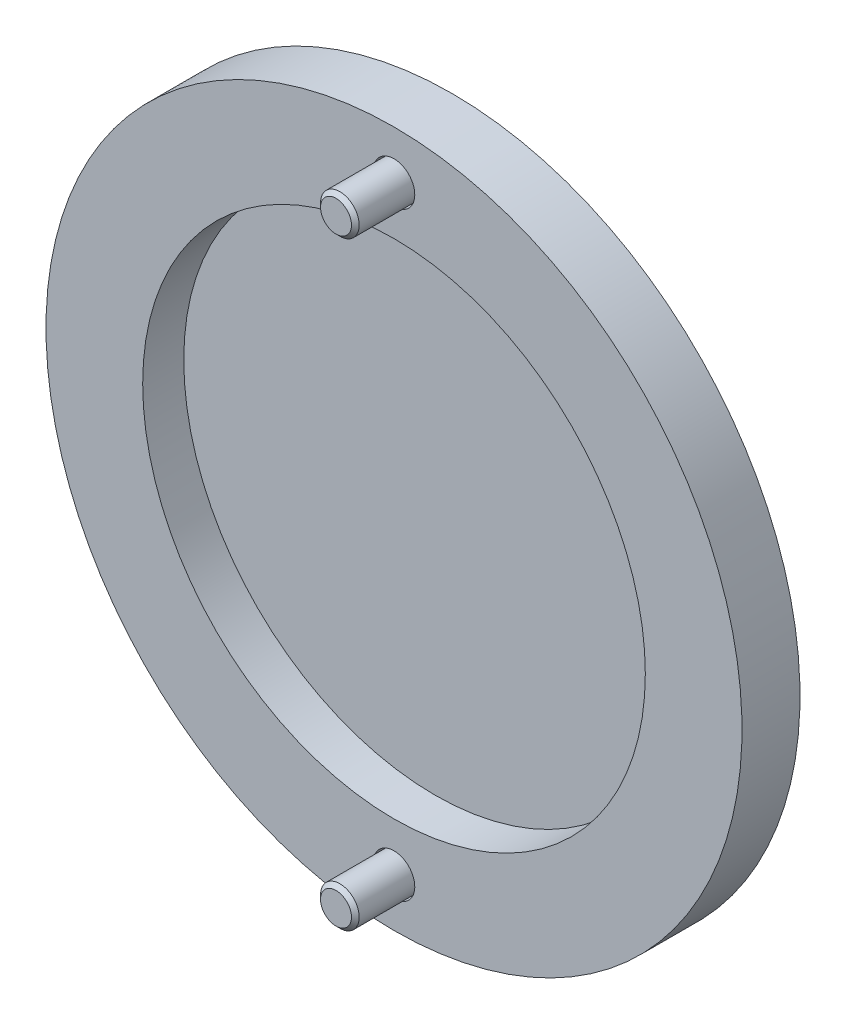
ISO-10303-21;
HEADER;
FILE_DESCRIPTION(('STEP AP214'),'2;1');
FILE_NAME('part.step','',(''),(''),'','','');
FILE_SCHEMA(('AUTOMOTIVE_DESIGN { 1 0 10303 214 1 1 1 1 }'));
ENDSEC;
DATA;
#1=APPLICATION_CONTEXT('core data for automotive mechanical design processes');
#2=APPLICATION_PROTOCOL_DEFINITION('international standard','automotive_design',2000,#1);
#3=PRODUCT_CONTEXT('',#1,'mechanical');
#4=PRODUCT('Part','Part','',(#3));
#5=PRODUCT_RELATED_PRODUCT_CATEGORY('part','',(#4));
#6=PRODUCT_DEFINITION_FORMATION('','',#4);
#7=PRODUCT_DEFINITION_CONTEXT('part definition',#1,'design');
#8=PRODUCT_DEFINITION('design','',#6,#7);
#9=PRODUCT_DEFINITION_SHAPE('','',#8);
#10=(LENGTH_UNIT() NAMED_UNIT(*) SI_UNIT(.MILLI.,.METRE.));
#11=(NAMED_UNIT(*) PLANE_ANGLE_UNIT() SI_UNIT($,.RADIAN.));
#12=(NAMED_UNIT(*) SI_UNIT($,.STERADIAN.) SOLID_ANGLE_UNIT());
#13=UNCERTAINTY_MEASURE_WITH_UNIT(LENGTH_MEASURE(1.E-05),#10,'distance_accuracy_value','');
#14=(GEOMETRIC_REPRESENTATION_CONTEXT(3) GLOBAL_UNCERTAINTY_ASSIGNED_CONTEXT((#13)) GLOBAL_UNIT_ASSIGNED_CONTEXT((#10,
#11,#12)) REPRESENTATION_CONTEXT('',''));
#15=CARTESIAN_POINT('',(0.,0.,0.));
#16=DIRECTION('',(0.,0.,1.));
#17=DIRECTION('',(1.,0.,0.));
#18=AXIS2_PLACEMENT_3D('',#15,#16,#17);
#19=CARTESIAN_POINT('',(-0.866025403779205,-32.5,-4.00000000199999));
#20=DIRECTION('',(0.,0.,-1.));
#21=DIRECTION('',(-1.,0.,0.));
#22=AXIS2_PLACEMENT_3D('',#19,#20,#21);
#23=PLANE('',#22);
#24=DIRECTION('',(-1.,0.,0.));
#25=VECTOR('',#24,1.);
#26=CARTESIAN_POINT('',(0.866025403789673,-32.5,-4.00000000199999));
#27=LINE('',#26,#25);
#28=CARTESIAN_POINT('',(0.866025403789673,-32.5,-4.00000000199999));
#29=VERTEX_POINT('',#28);
#30=CARTESIAN_POINT('',(-0.866025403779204,-32.5,-4.00000000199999));
#31=VERTEX_POINT('',#30);
#32=EDGE_CURVE('E747',#29,#31,#27,.T.);
#33=ORIENTED_EDGE('',*,*,#32,.T.);
#34=DIRECTION('',(-0.5,0.866025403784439,0.));
#35=VECTOR('',#34,1.);
#36=CARTESIAN_POINT('',(-0.866025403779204,-32.5,-4.00000000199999));
#37=LINE('',#36,#35);
#38=CARTESIAN_POINT('',(-1.73205080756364,-31.,-4.00000000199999));
#39=VERTEX_POINT('',#38);
#40=EDGE_CURVE('E752',#31,#39,#37,.T.);
#41=ORIENTED_EDGE('',*,*,#40,.T.);
#42=DIRECTION('',(0.5,0.866025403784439,0.));
#43=VECTOR('',#42,1.);
#44=CARTESIAN_POINT('',(-1.73205080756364,-31.,-4.00000000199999));
#45=LINE('',#44,#43);
#46=CARTESIAN_POINT('',(-0.866025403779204,-29.5,-4.00000000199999));
#47=VERTEX_POINT('',#46);
#48=EDGE_CURVE('E755',#39,#47,#45,.T.);
#49=ORIENTED_EDGE('',*,*,#48,.T.);
#50=DIRECTION('',(1.,0.,0.));
#51=VECTOR('',#50,1.);
#52=CARTESIAN_POINT('',(-0.866025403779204,-29.5,-4.00000000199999));
#53=LINE('',#52,#51);
#54=CARTESIAN_POINT('',(0.866025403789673,-29.5,-4.00000000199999));
#55=VERTEX_POINT('',#54);
#56=EDGE_CURVE('E137',#47,#55,#53,.T.);
#57=ORIENTED_EDGE('',*,*,#56,.T.);
#58=DIRECTION('',(0.5,-0.866025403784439,0.));
#59=VECTOR('',#58,1.);
#60=CARTESIAN_POINT('',(0.866025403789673,-29.5,-4.00000000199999));
#61=LINE('',#60,#59);
#62=CARTESIAN_POINT('',(1.73205080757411,-31.,-4.00000000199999));
#63=VERTEX_POINT('',#62);
#64=EDGE_CURVE('E120',#55,#63,#61,.T.);
#65=ORIENTED_EDGE('',*,*,#64,.T.);
#66=DIRECTION('',(-0.5,-0.866025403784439,0.));
#67=VECTOR('',#66,1.);
#68=CARTESIAN_POINT('',(1.73205080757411,-31.,-4.00000000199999));
#69=LINE('',#68,#67);
#70=EDGE_CURVE('E134',#63,#29,#69,.T.);
#71=ORIENTED_EDGE('',*,*,#70,.T.);
#72=EDGE_LOOP('',(#33,#41,#49,#57,#65,#71));
#73=FACE_BOUND('',#72,.T.);
#74=ADVANCED_FACE('F16',(#73),#23,.T.);
#75=CARTESIAN_POINT('',(-0.866025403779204,-32.5,-4.00000000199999));
#76=DIRECTION('',(-0.866025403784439,-0.5,0.));
#77=DIRECTION('',(-0.5,0.866025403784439,0.));
#78=AXIS2_PLACEMENT_3D('',#75,#76,#77);
#79=PLANE('',#78);
#80=DIRECTION('',(-0.5,0.866025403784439,0.));
#81=VECTOR('',#80,1.);
#82=CARTESIAN_POINT('',(-0.866025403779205,-32.5,-6.000000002));
#83=LINE('',#82,#81);
#84=CARTESIAN_POINT('',(-0.866025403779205,-32.5,-6.000000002));
#85=VERTEX_POINT('',#84);
#86=CARTESIAN_POINT('',(-1.73205080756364,-31.,-6.000000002));
#87=VERTEX_POINT('',#86);
#88=EDGE_CURVE('E758',#85,#87,#83,.T.);
#89=ORIENTED_EDGE('',*,*,#88,.T.);
#90=DIRECTION('',(0.,0.,-1.));
#91=VECTOR('',#90,1.);
#92=CARTESIAN_POINT('',(-1.73205080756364,-31.,-4.00000000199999));
#93=LINE('',#92,#91);
#94=EDGE_CURVE('E91',#39,#87,#93,.T.);
#95=ORIENTED_EDGE('',*,*,#94,.F.);
#96=ORIENTED_EDGE('',*,*,#40,.F.);
#97=DIRECTION('',(0.,0.,-1.));
#98=VECTOR('',#97,1.);
#99=CARTESIAN_POINT('',(-0.866025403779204,-32.5,-4.00000000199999));
#100=LINE('',#99,#98);
#101=EDGE_CURVE('E141',#31,#85,#100,.T.);
#102=ORIENTED_EDGE('',*,*,#101,.T.);
#103=EDGE_LOOP('',(#89,#95,#96,#102));
#104=FACE_BOUND('',#103,.T.);
#105=ADVANCED_FACE('F409',(#104),#79,.F.);
#106=CARTESIAN_POINT('',(-1.73205080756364,-31.,-4.00000000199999));
#107=DIRECTION('',(-0.866025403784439,0.5,0.));
#108=DIRECTION('',(0.5,0.866025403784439,0.));
#109=AXIS2_PLACEMENT_3D('',#106,#107,#108);
#110=PLANE('',#109);
#111=DIRECTION('',(0.5,0.866025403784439,0.));
#112=VECTOR('',#111,1.);
#113=CARTESIAN_POINT('',(-1.73205080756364,-31.,-6.000000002));
#114=LINE('',#113,#112);
#115=CARTESIAN_POINT('',(-0.866025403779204,-29.5,-6.000000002));
#116=VERTEX_POINT('',#115);
#117=EDGE_CURVE('E742',#87,#116,#114,.T.);
#118=ORIENTED_EDGE('',*,*,#117,.T.);
#119=DIRECTION('',(0.,0.,-1.));
#120=VECTOR('',#119,1.);
#121=CARTESIAN_POINT('',(-0.866025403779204,-29.5,-4.00000000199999));
#122=LINE('',#121,#120);
#123=EDGE_CURVE('E149',#47,#116,#122,.T.);
#124=ORIENTED_EDGE('',*,*,#123,.F.);
#125=ORIENTED_EDGE('',*,*,#48,.F.);
#126=ORIENTED_EDGE('',*,*,#94,.T.);
#127=EDGE_LOOP('',(#118,#124,#125,#126));
#128=FACE_BOUND('',#127,.T.);
#129=ADVANCED_FACE('F412',(#128),#110,.F.);
#130=CARTESIAN_POINT('',(-0.866025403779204,-29.5,-4.00000000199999));
#131=DIRECTION('',(0.,1.,0.));
#132=DIRECTION('',(1.,0.,0.));
#133=AXIS2_PLACEMENT_3D('',#130,#131,#132);
#134=PLANE('',#133);
#135=DIRECTION('',(1.,0.,0.));
#136=VECTOR('',#135,1.);
#137=CARTESIAN_POINT('',(-0.866025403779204,-29.5,-6.000000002));
#138=LINE('',#137,#136);
#139=CARTESIAN_POINT('',(0.866025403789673,-29.5,-6.000000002));
#140=VERTEX_POINT('',#139);
#141=EDGE_CURVE('E740',#116,#140,#138,.T.);
#142=ORIENTED_EDGE('',*,*,#141,.T.);
#143=DIRECTION('',(0.,0.,-1.));
#144=VECTOR('',#143,1.);
#145=CARTESIAN_POINT('',(0.866025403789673,-29.5,-4.00000000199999));
#146=LINE('',#145,#144);
#147=EDGE_CURVE('E129',#55,#140,#146,.T.);
#148=ORIENTED_EDGE('',*,*,#147,.F.);
#149=ORIENTED_EDGE('',*,*,#56,.F.);
#150=ORIENTED_EDGE('',*,*,#123,.T.);
#151=EDGE_LOOP('',(#142,#148,#149,#150));
#152=FACE_BOUND('',#151,.T.);
#153=ADVANCED_FACE('F416',(#152),#134,.F.);
#154=CARTESIAN_POINT('',(0.866025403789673,-29.5,-4.00000000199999));
#155=DIRECTION('',(0.866025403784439,0.5,0.));
#156=DIRECTION('',(0.5,-0.866025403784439,0.));
#157=AXIS2_PLACEMENT_3D('',#154,#155,#156);
#158=PLANE('',#157);
#159=DIRECTION('',(0.5,-0.866025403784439,0.));
#160=VECTOR('',#159,1.);
#161=CARTESIAN_POINT('',(0.866025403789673,-29.5,-6.000000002));
#162=LINE('',#161,#160);
#163=CARTESIAN_POINT('',(1.73205080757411,-31.,-6.000000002));
#164=VERTEX_POINT('',#163);
#165=EDGE_CURVE('E123',#140,#164,#162,.T.);
#166=ORIENTED_EDGE('',*,*,#165,.T.);
#167=DIRECTION('',(0.,0.,-1.));
#168=VECTOR('',#167,1.);
#169=CARTESIAN_POINT('',(1.73205080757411,-31.,-4.00000000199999));
#170=LINE('',#169,#168);
#171=EDGE_CURVE('E117',#63,#164,#170,.T.);
#172=ORIENTED_EDGE('',*,*,#171,.F.);
#173=ORIENTED_EDGE('',*,*,#64,.F.);
#174=ORIENTED_EDGE('',*,*,#147,.T.);
#175=EDGE_LOOP('',(#166,#172,#173,#174));
#176=FACE_BOUND('',#175,.T.);
#177=ADVANCED_FACE('F119',(#176),#158,.F.);
#178=CARTESIAN_POINT('',(1.73205080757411,-31.,-4.00000000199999));
#179=DIRECTION('',(0.866025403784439,-0.5,0.));
#180=DIRECTION('',(-0.5,-0.866025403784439,0.));
#181=AXIS2_PLACEMENT_3D('',#178,#179,#180);
#182=PLANE('',#181);
#183=DIRECTION('',(-0.5,-0.866025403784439,0.));
#184=VECTOR('',#183,1.);
#185=CARTESIAN_POINT('',(1.73205080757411,-31.,-6.000000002));
#186=LINE('',#185,#184);
#187=CARTESIAN_POINT('',(0.866025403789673,-32.5,-6.000000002));
#188=VERTEX_POINT('',#187);
#189=EDGE_CURVE('E745',#164,#188,#186,.T.);
#190=ORIENTED_EDGE('',*,*,#189,.T.);
#191=DIRECTION('',(0.,0.,-1.));
#192=VECTOR('',#191,1.);
#193=CARTESIAN_POINT('',(0.866025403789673,-32.5,-4.00000000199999));
#194=LINE('',#193,#192);
#195=EDGE_CURVE('E128',#29,#188,#194,.T.);
#196=ORIENTED_EDGE('',*,*,#195,.F.);
#197=ORIENTED_EDGE('',*,*,#70,.F.);
#198=ORIENTED_EDGE('',*,*,#171,.T.);
#199=EDGE_LOOP('',(#190,#196,#197,#198));
#200=FACE_BOUND('',#199,.T.);
#201=ADVANCED_FACE('F139',(#200),#182,.F.);
#202=CARTESIAN_POINT('',(0.866025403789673,-32.5,-4.00000000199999));
#203=DIRECTION('',(0.,-1.,0.));
#204=DIRECTION('',(-1.,0.,0.));
#205=AXIS2_PLACEMENT_3D('',#202,#203,#204);
#206=PLANE('',#205);
#207=DIRECTION('',(-1.,0.,0.));
#208=VECTOR('',#207,1.);
#209=CARTESIAN_POINT('',(0.866025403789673,-32.5,-6.000000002));
#210=LINE('',#209,#208);
#211=EDGE_CURVE('E35',#188,#85,#210,.T.);
#212=ORIENTED_EDGE('',*,*,#211,.T.);
#213=ORIENTED_EDGE('',*,*,#101,.F.);
#214=ORIENTED_EDGE('',*,*,#32,.F.);
#215=ORIENTED_EDGE('',*,*,#195,.T.);
#216=EDGE_LOOP('',(#212,#213,#214,#215));
#217=FACE_BOUND('',#216,.T.);
#218=ADVANCED_FACE('F395',(#217),#206,.F.);
#219=CARTESIAN_POINT('',(0.,-27.9,-6.000000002));
#220=DIRECTION('',(0.,0.,-1.));
#221=DIRECTION('',(-1.,0.,0.));
#222=AXIS2_PLACEMENT_3D('',#219,#220,#221);
#223=PLANE('',#222);
#224=ORIENTED_EDGE('',*,*,#211,.F.);
#225=ORIENTED_EDGE('',*,*,#189,.F.);
#226=ORIENTED_EDGE('',*,*,#165,.F.);
#227=ORIENTED_EDGE('',*,*,#141,.F.);
#228=ORIENTED_EDGE('',*,*,#117,.F.);
#229=ORIENTED_EDGE('',*,*,#88,.F.);
#230=EDGE_LOOP('',(#224,#225,#226,#227,#228,#229));
#231=FACE_BOUND('',#230,.T.);
#232=CARTESIAN_POINT('',(0.,-31.,-6.000000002));
#233=DIRECTION('',(0.,0.,1.));
#234=DIRECTION('',(1.,0.,0.));
#235=AXIS2_PLACEMENT_3D('',#232,#233,#234);
#236=CIRCLE('',#235,3.1);
#237=CARTESIAN_POINT('',(3.09999999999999,-31.,-6.000000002));
#238=VERTEX_POINT('',#237);
#239=EDGE_CURVE('E157',#238,#238,#236,.T.);
#240=ORIENTED_EDGE('',*,*,#239,.F.);
#241=EDGE_LOOP('',(#240));
#242=FACE_BOUND('',#241,.T.);
#243=ADVANCED_FACE('F391',(#231,#242),#223,.T.);
#244=CARTESIAN_POINT('',(0.,-31.,-5.600000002));
#245=DIRECTION('',(0.,0.,1.));
#246=DIRECTION('',(1.,0.,0.));
#247=AXIS2_PLACEMENT_3D('',#244,#245,#246);
#248=CONICAL_SURFACE('',#247,3.5,0.78539816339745);
#249=ORIENTED_EDGE('',*,*,#239,.T.);
#250=EDGE_LOOP('',(#249));
#251=FACE_BOUND('',#250,.T.);
#252=CARTESIAN_POINT('',(0.,-31.,-5.600000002));
#253=DIRECTION('',(0.,0.,1.));
#254=DIRECTION('',(1.,0.,0.));
#255=AXIS2_PLACEMENT_3D('',#252,#253,#254);
#256=CIRCLE('',#255,3.5);
#257=CARTESIAN_POINT('',(3.49999999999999,-31.,-5.600000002));
#258=VERTEX_POINT('',#257);
#259=EDGE_CURVE('E160',#258,#258,#256,.T.);
#260=ORIENTED_EDGE('',*,*,#259,.F.);
#261=EDGE_LOOP('',(#260));
#262=FACE_BOUND('',#261,.T.);
#263=ADVANCED_FACE('F387',(#251,#262),#248,.T.);
#264=CARTESIAN_POINT('',(0.,-31.,-2.00000000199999));
#265=DIRECTION('',(0.,0.,1.));
#266=DIRECTION('',(1.,0.,0.));
#267=AXIS2_PLACEMENT_3D('',#264,#265,#266);
#268=CYLINDRICAL_SURFACE('',#267,3.5);
#269=ORIENTED_EDGE('',*,*,#259,.T.);
#270=EDGE_LOOP('',(#269));
#271=FACE_BOUND('',#270,.T.);
#272=CARTESIAN_POINT('',(0.,-31.,-2.00000000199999));
#273=DIRECTION('',(0.,0.,1.));
#274=DIRECTION('',(1.,0.,0.));
#275=AXIS2_PLACEMENT_3D('',#272,#273,#274);
#276=CIRCLE('',#275,3.5);
#277=CARTESIAN_POINT('',(3.49999999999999,-31.,-2.00000000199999));
#278=VERTEX_POINT('',#277);
#279=EDGE_CURVE('E163',#278,#278,#276,.T.);
#280=ORIENTED_EDGE('',*,*,#279,.F.);
#281=EDGE_LOOP('',(#280));
#282=FACE_BOUND('',#281,.T.);
#283=ADVANCED_FACE('F383',(#271,#282),#268,.T.);
#284=CARTESIAN_POINT('',(0.,-31.,-2.00000000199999));
#285=DIRECTION('',(0.,0.,1.));
#286=DIRECTION('',(1.,0.,0.));
#287=AXIS2_PLACEMENT_3D('',#284,#285,#286);
#288=PLANE('',#287);
#289=CARTESIAN_POINT('',(0.,-31.,-2.00000000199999));
#290=DIRECTION('',(0.,0.,1.));
#291=DIRECTION('',(1.,0.,0.));
#292=AXIS2_PLACEMENT_3D('',#289,#290,#291);
#293=CIRCLE('',#292,2.);
#294=CARTESIAN_POINT('',(1.99999999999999,-31.,-2.00000000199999));
#295=VERTEX_POINT('',#294);
#296=EDGE_CURVE('E26',#295,#295,#293,.T.);
#297=ORIENTED_EDGE('',*,*,#296,.F.);
#298=EDGE_LOOP('',(#297));
#299=FACE_BOUND('',#298,.T.);
#300=CARTESIAN_POINT('',(0.,-31.,-2.00000000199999));
#301=DIRECTION('',(0.,0.,1.));
#302=DIRECTION('',(0.,-1.,0.));
#303=AXIS2_PLACEMENT_3D('',#300,#301,#302);
#304=CIRCLE('',#303,2.15);
#305=CARTESIAN_POINT('',(0.,-33.15,-2.00000000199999));
#306=VERTEX_POINT('',#305);
#307=EDGE_CURVE('E10',#306,#306,#304,.T.);
#308=ORIENTED_EDGE('',*,*,#307,.T.);
#309=EDGE_LOOP('',(#308));
#310=FACE_BOUND('',#309,.T.);
#311=ADVANCED_FACE('F379',(#299,#310),#288,.T.);
#312=CARTESIAN_POINT('',(0.,-31.,5.999999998));
#313=DIRECTION('',(0.,0.,1.));
#314=DIRECTION('',(1.,0.,0.));
#315=AXIS2_PLACEMENT_3D('',#312,#313,#314);
#316=PLANE('',#315);
#317=CARTESIAN_POINT('',(0.,-31.,5.999999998));
#318=DIRECTION('',(0.,0.,1.));
#319=DIRECTION('',(1.,0.,0.));
#320=AXIS2_PLACEMENT_3D('',#317,#318,#319);
#321=CIRCLE('',#320,1.6);
#322=CARTESIAN_POINT('',(1.6,-31.,5.999999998));
#323=VERTEX_POINT('',#322);
#324=EDGE_CURVE('E154',#323,#323,#321,.T.);
#325=ORIENTED_EDGE('',*,*,#324,.T.);
#326=EDGE_LOOP('',(#325));
#327=FACE_BOUND('',#326,.T.);
#328=ADVANCED_FACE('F382',(#327),#316,.T.);
#329=CARTESIAN_POINT('',(0.,-31.,5.999999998));
#330=DIRECTION('',(0.,0.,-1.));
#331=DIRECTION('',(-1.,0.,0.));
#332=AXIS2_PLACEMENT_3D('',#329,#330,#331);
#333=CONICAL_SURFACE('',#332,1.6,0.78539816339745);
#334=CARTESIAN_POINT('',(0.,-31.,5.599999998));
#335=DIRECTION('',(0.,0.,1.));
#336=DIRECTION('',(1.,0.,0.));
#337=AXIS2_PLACEMENT_3D('',#334,#335,#336);
#338=CIRCLE('',#337,2.);
#339=CARTESIAN_POINT('',(2.,-31.,5.599999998));
#340=VERTEX_POINT('',#339);
#341=EDGE_CURVE('E146',#340,#340,#338,.T.);
#342=ORIENTED_EDGE('',*,*,#341,.T.);
#343=EDGE_LOOP('',(#342));
#344=FACE_BOUND('',#343,.T.);
#345=ORIENTED_EDGE('',*,*,#324,.F.);
#346=EDGE_LOOP('',(#345));
#347=FACE_BOUND('',#346,.T.);
#348=ADVANCED_FACE('F399',(#344,#347),#333,.T.);
#349=CARTESIAN_POINT('',(0.,-31.,-2.00000000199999));
#350=DIRECTION('',(0.,0.,1.));
#351=DIRECTION('',(1.,0.,0.));
#352=AXIS2_PLACEMENT_3D('',#349,#350,#351);
#353=CYLINDRICAL_SURFACE('',#352,2.);
#354=ORIENTED_EDGE('',*,*,#296,.T.);
#355=EDGE_LOOP('',(#354));
#356=FACE_BOUND('',#355,.T.);
#357=ORIENTED_EDGE('',*,*,#341,.F.);
#358=EDGE_LOOP('',(#357));
#359=FACE_BOUND('',#358,.T.);
#360=ADVANCED_FACE('F377',(#356,#359),#353,.T.);
#361=CARTESIAN_POINT('',(-0.866025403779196,29.5,-4.00000000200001));
#362=DIRECTION('',(0.,0.,-1.));
#363=DIRECTION('',(-1.,0.,0.));
#364=AXIS2_PLACEMENT_3D('',#361,#362,#363);
#365=PLANE('',#364);
#366=DIRECTION('',(-1.,0.,0.));
#367=VECTOR('',#366,1.);
#368=CARTESIAN_POINT('',(0.866025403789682,29.5,-4.00000000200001));
#369=LINE('',#368,#367);
#370=CARTESIAN_POINT('',(0.866025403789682,29.5,-4.00000000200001));
#371=VERTEX_POINT('',#370);
#372=CARTESIAN_POINT('',(-0.866025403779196,29.5,-4.00000000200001));
#373=VERTEX_POINT('',#372);
#374=EDGE_CURVE('E183',#371,#373,#369,.T.);
#375=ORIENTED_EDGE('',*,*,#374,.T.);
#376=DIRECTION('',(-0.5,0.866025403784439,0.));
#377=VECTOR('',#376,1.);
#378=CARTESIAN_POINT('',(-0.866025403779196,29.5,-4.00000000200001));
#379=LINE('',#378,#377);
#380=CARTESIAN_POINT('',(-1.73205080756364,31.,-4.00000000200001));
#381=VERTEX_POINT('',#380);
#382=EDGE_CURVE('E186',#373,#381,#379,.T.);
#383=ORIENTED_EDGE('',*,*,#382,.T.);
#384=DIRECTION('',(0.5,0.866025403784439,0.));
#385=VECTOR('',#384,1.);
#386=CARTESIAN_POINT('',(-1.73205080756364,31.,-4.00000000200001));
#387=LINE('',#386,#385);
#388=CARTESIAN_POINT('',(-0.866025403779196,32.5,-4.00000000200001));
#389=VERTEX_POINT('',#388);
#390=EDGE_CURVE('E189',#381,#389,#387,.T.);
#391=ORIENTED_EDGE('',*,*,#390,.T.);
#392=DIRECTION('',(1.,0.,0.));
#393=VECTOR('',#392,1.);
#394=CARTESIAN_POINT('',(-0.866025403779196,32.5,-4.00000000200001));
#395=LINE('',#394,#393);
#396=CARTESIAN_POINT('',(0.866025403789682,32.5,-4.00000000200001));
#397=VERTEX_POINT('',#396);
#398=EDGE_CURVE('E192',#389,#397,#395,.T.);
#399=ORIENTED_EDGE('',*,*,#398,.T.);
#400=DIRECTION('',(0.5,-0.866025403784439,0.));
#401=VECTOR('',#400,1.);
#402=CARTESIAN_POINT('',(0.866025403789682,32.5,-4.00000000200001));
#403=LINE('',#402,#401);
#404=CARTESIAN_POINT('',(1.73205080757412,31.,-4.00000000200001));
#405=VERTEX_POINT('',#404);
#406=EDGE_CURVE('E195',#397,#405,#403,.T.);
#407=ORIENTED_EDGE('',*,*,#406,.T.);
#408=DIRECTION('',(-0.5,-0.866025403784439,0.));
#409=VECTOR('',#408,1.);
#410=CARTESIAN_POINT('',(1.73205080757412,31.,-4.00000000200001));
#411=LINE('',#410,#409);
#412=EDGE_CURVE('E198',#405,#371,#411,.T.);
#413=ORIENTED_EDGE('',*,*,#412,.T.);
#414=EDGE_LOOP('',(#375,#383,#391,#399,#407,#413));
#415=FACE_BOUND('',#414,.T.);
#416=ADVANCED_FACE('F300',(#415),#365,.T.);
#417=CARTESIAN_POINT('',(-0.866025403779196,29.5,-4.00000000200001));
#418=DIRECTION('',(-0.866025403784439,-0.5,0.));
#419=DIRECTION('',(-0.5,0.866025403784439,0.));
#420=AXIS2_PLACEMENT_3D('',#417,#418,#419);
#421=PLANE('',#420);
#422=DIRECTION('',(-0.5,0.866025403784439,0.));
#423=VECTOR('',#422,1.);
#424=CARTESIAN_POINT('',(-0.866025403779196,29.5,-6.00000000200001));
#425=LINE('',#424,#423);
#426=CARTESIAN_POINT('',(-0.866025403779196,29.5,-6.00000000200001));
#427=VERTEX_POINT('',#426);
#428=CARTESIAN_POINT('',(-1.73205080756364,31.,-6.00000000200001));
#429=VERTEX_POINT('',#428);
#430=EDGE_CURVE('E169',#427,#429,#425,.T.);
#431=ORIENTED_EDGE('',*,*,#430,.T.);
#432=DIRECTION('',(0.,0.,-1.));
#433=VECTOR('',#432,1.);
#434=CARTESIAN_POINT('',(-1.73205080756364,31.,-4.00000000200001));
#435=LINE('',#434,#433);
#436=EDGE_CURVE('E210',#381,#429,#435,.T.);
#437=ORIENTED_EDGE('',*,*,#436,.F.);
#438=ORIENTED_EDGE('',*,*,#382,.F.);
#439=DIRECTION('',(0.,0.,-1.));
#440=VECTOR('',#439,1.);
#441=CARTESIAN_POINT('',(-0.866025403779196,29.5,-4.00000000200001));
#442=LINE('',#441,#440);
#443=EDGE_CURVE('E201',#373,#427,#442,.T.);
#444=ORIENTED_EDGE('',*,*,#443,.T.);
#445=EDGE_LOOP('',(#431,#437,#438,#444));
#446=FACE_BOUND('',#445,.T.);
#447=ADVANCED_FACE('F357',(#446),#421,.F.);
#448=CARTESIAN_POINT('',(-1.73205080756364,31.,-4.00000000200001));
#449=DIRECTION('',(-0.866025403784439,0.5,0.));
#450=DIRECTION('',(0.5,0.866025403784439,0.));
#451=AXIS2_PLACEMENT_3D('',#448,#449,#450);
#452=PLANE('',#451);
#453=DIRECTION('',(0.5,0.866025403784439,0.));
#454=VECTOR('',#453,1.);
#455=CARTESIAN_POINT('',(-1.73205080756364,31.,-6.00000000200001));
#456=LINE('',#455,#454);
#457=CARTESIAN_POINT('',(-0.866025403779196,32.5,-6.00000000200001));
#458=VERTEX_POINT('',#457);
#459=EDGE_CURVE('E172',#429,#458,#456,.T.);
#460=ORIENTED_EDGE('',*,*,#459,.T.);
#461=DIRECTION('',(0.,0.,-1.));
#462=VECTOR('',#461,1.);
#463=CARTESIAN_POINT('',(-0.866025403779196,32.5,-4.00000000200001));
#464=LINE('',#463,#462);
#465=EDGE_CURVE('E208',#389,#458,#464,.T.);
#466=ORIENTED_EDGE('',*,*,#465,.F.);
#467=ORIENTED_EDGE('',*,*,#390,.F.);
#468=ORIENTED_EDGE('',*,*,#436,.T.);
#469=EDGE_LOOP('',(#460,#466,#467,#468));
#470=FACE_BOUND('',#469,.T.);
#471=ADVANCED_FACE('F360',(#470),#452,.F.);
#472=CARTESIAN_POINT('',(-0.866025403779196,32.5,-4.00000000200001));
#473=DIRECTION('',(0.,1.,0.));
#474=DIRECTION('',(1.,0.,0.));
#475=AXIS2_PLACEMENT_3D('',#472,#473,#474);
#476=PLANE('',#475);
#477=DIRECTION('',(1.,0.,0.));
#478=VECTOR('',#477,1.);
#479=CARTESIAN_POINT('',(-0.866025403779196,32.5,-6.00000000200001));
#480=LINE('',#479,#478);
#481=CARTESIAN_POINT('',(0.866025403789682,32.5,-6.00000000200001));
#482=VERTEX_POINT('',#481);
#483=EDGE_CURVE('E175',#458,#482,#480,.T.);
#484=ORIENTED_EDGE('',*,*,#483,.T.);
#485=DIRECTION('',(0.,0.,-1.));
#486=VECTOR('',#485,1.);
#487=CARTESIAN_POINT('',(0.866025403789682,32.5,-4.00000000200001));
#488=LINE('',#487,#486);
#489=EDGE_CURVE('E206',#397,#482,#488,.T.);
#490=ORIENTED_EDGE('',*,*,#489,.F.);
#491=ORIENTED_EDGE('',*,*,#398,.F.);
#492=ORIENTED_EDGE('',*,*,#465,.T.);
#493=EDGE_LOOP('',(#484,#490,#491,#492));
#494=FACE_BOUND('',#493,.T.);
#495=ADVANCED_FACE('F364',(#494),#476,.F.);
#496=CARTESIAN_POINT('',(0.866025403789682,32.5,-4.00000000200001));
#497=DIRECTION('',(0.866025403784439,0.5,0.));
#498=DIRECTION('',(0.5,-0.866025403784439,0.));
#499=AXIS2_PLACEMENT_3D('',#496,#497,#498);
#500=PLANE('',#499);
#501=DIRECTION('',(0.5,-0.866025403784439,0.));
#502=VECTOR('',#501,1.);
#503=CARTESIAN_POINT('',(0.866025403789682,32.5,-6.00000000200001));
#504=LINE('',#503,#502);
#505=CARTESIAN_POINT('',(1.73205080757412,31.,-6.00000000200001));
#506=VERTEX_POINT('',#505);
#507=EDGE_CURVE('E178',#482,#506,#504,.T.);
#508=ORIENTED_EDGE('',*,*,#507,.T.);
#509=DIRECTION('',(0.,0.,-1.));
#510=VECTOR('',#509,1.);
#511=CARTESIAN_POINT('',(1.73205080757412,31.,-4.00000000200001));
#512=LINE('',#511,#510);
#513=EDGE_CURVE('E204',#405,#506,#512,.T.);
#514=ORIENTED_EDGE('',*,*,#513,.F.);
#515=ORIENTED_EDGE('',*,*,#406,.F.);
#516=ORIENTED_EDGE('',*,*,#489,.T.);
#517=EDGE_LOOP('',(#508,#514,#515,#516));
#518=FACE_BOUND('',#517,.T.);
#519=ADVANCED_FACE('F368',(#518),#500,.F.);
#520=CARTESIAN_POINT('',(1.73205080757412,31.,-4.00000000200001));
#521=DIRECTION('',(0.866025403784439,-0.5,0.));
#522=DIRECTION('',(-0.5,-0.866025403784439,0.));
#523=AXIS2_PLACEMENT_3D('',#520,#521,#522);
#524=PLANE('',#523);
#525=DIRECTION('',(-0.5,-0.866025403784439,0.));
#526=VECTOR('',#525,1.);
#527=CARTESIAN_POINT('',(1.73205080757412,31.,-6.00000000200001));
#528=LINE('',#527,#526);
#529=CARTESIAN_POINT('',(0.866025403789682,29.5,-6.00000000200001));
#530=VERTEX_POINT('',#529);
#531=EDGE_CURVE('E181',#506,#530,#528,.T.);
#532=ORIENTED_EDGE('',*,*,#531,.T.);
#533=DIRECTION('',(0.,0.,-1.));
#534=VECTOR('',#533,1.);
#535=CARTESIAN_POINT('',(0.866025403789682,29.5,-4.00000000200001));
#536=LINE('',#535,#534);
#537=EDGE_CURVE('E76',#371,#530,#536,.T.);
#538=ORIENTED_EDGE('',*,*,#537,.F.);
#539=ORIENTED_EDGE('',*,*,#412,.F.);
#540=ORIENTED_EDGE('',*,*,#513,.T.);
#541=EDGE_LOOP('',(#532,#538,#539,#540));
#542=FACE_BOUND('',#541,.T.);
#543=ADVANCED_FACE('F356',(#542),#524,.F.);
#544=CARTESIAN_POINT('',(0.866025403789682,29.5,-4.00000000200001));
#545=DIRECTION('',(0.,-1.,0.));
#546=DIRECTION('',(-1.,0.,0.));
#547=AXIS2_PLACEMENT_3D('',#544,#545,#546);
#548=PLANE('',#547);
#549=DIRECTION('',(-1.,0.,0.));
#550=VECTOR('',#549,1.);
#551=CARTESIAN_POINT('',(0.866025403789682,29.5,-6.00000000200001));
#552=LINE('',#551,#550);
#553=EDGE_CURVE('E82',#530,#427,#552,.T.);
#554=ORIENTED_EDGE('',*,*,#553,.T.);
#555=ORIENTED_EDGE('',*,*,#443,.F.);
#556=ORIENTED_EDGE('',*,*,#374,.F.);
#557=ORIENTED_EDGE('',*,*,#537,.T.);
#558=EDGE_LOOP('',(#554,#555,#556,#557));
#559=FACE_BOUND('',#558,.T.);
#560=ADVANCED_FACE('F343',(#559),#548,.F.);
#561=CARTESIAN_POINT('',(0.,34.1,-6.00000000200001));
#562=DIRECTION('',(0.,0.,-1.));
#563=DIRECTION('',(-1.,0.,0.));
#564=AXIS2_PLACEMENT_3D('',#561,#562,#563);
#565=PLANE('',#564);
#566=ORIENTED_EDGE('',*,*,#553,.F.);
#567=ORIENTED_EDGE('',*,*,#531,.F.);
#568=ORIENTED_EDGE('',*,*,#507,.F.);
#569=ORIENTED_EDGE('',*,*,#483,.F.);
#570=ORIENTED_EDGE('',*,*,#459,.F.);
#571=ORIENTED_EDGE('',*,*,#430,.F.);
#572=EDGE_LOOP('',(#566,#567,#568,#569,#570,#571));
#573=FACE_BOUND('',#572,.T.);
#574=CARTESIAN_POINT('',(0.,31.,-6.00000000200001));
#575=DIRECTION('',(0.,0.,1.));
#576=DIRECTION('',(1.,0.,0.));
#577=AXIS2_PLACEMENT_3D('',#574,#575,#576);
#578=CIRCLE('',#577,3.1);
#579=CARTESIAN_POINT('',(3.1,31.,-6.00000000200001));
#580=VERTEX_POINT('',#579);
#581=EDGE_CURVE('E218',#580,#580,#578,.T.);
#582=ORIENTED_EDGE('',*,*,#581,.F.);
#583=EDGE_LOOP('',(#582));
#584=FACE_BOUND('',#583,.T.);
#585=ADVANCED_FACE('F340',(#573,#584),#565,.T.);
#586=CARTESIAN_POINT('',(0.,31.,5.99999999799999));
#587=DIRECTION('',(0.,0.,1.));
#588=DIRECTION('',(1.,0.,0.));
#589=AXIS2_PLACEMENT_3D('',#586,#587,#588);
#590=PLANE('',#589);
#591=CARTESIAN_POINT('',(0.,31.,5.99999999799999));
#592=DIRECTION('',(0.,0.,1.));
#593=DIRECTION('',(1.,0.,0.));
#594=AXIS2_PLACEMENT_3D('',#591,#592,#593);
#595=CIRCLE('',#594,1.6);
#596=CARTESIAN_POINT('',(1.6,31.,5.99999999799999));
#597=VERTEX_POINT('',#596);
#598=EDGE_CURVE('E215',#597,#597,#595,.T.);
#599=ORIENTED_EDGE('',*,*,#598,.T.);
#600=EDGE_LOOP('',(#599));
#601=FACE_BOUND('',#600,.T.);
#602=ADVANCED_FACE('F277',(#601),#590,.T.);
#603=CARTESIAN_POINT('',(0.,31.,-5.60000000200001));
#604=DIRECTION('',(0.,0.,1.));
#605=DIRECTION('',(1.,0.,0.));
#606=AXIS2_PLACEMENT_3D('',#603,#604,#605);
#607=CONICAL_SURFACE('',#606,3.5,0.78539816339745);
#608=ORIENTED_EDGE('',*,*,#581,.T.);
#609=EDGE_LOOP('',(#608));
#610=FACE_BOUND('',#609,.T.);
#611=CARTESIAN_POINT('',(0.,31.,-5.60000000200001));
#612=DIRECTION('',(0.,0.,1.));
#613=DIRECTION('',(1.,0.,0.));
#614=AXIS2_PLACEMENT_3D('',#611,#612,#613);
#615=CIRCLE('',#614,3.5);
#616=CARTESIAN_POINT('',(3.5,31.,-5.60000000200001));
#617=VERTEX_POINT('',#616);
#618=EDGE_CURVE('E221',#617,#617,#615,.T.);
#619=ORIENTED_EDGE('',*,*,#618,.F.);
#620=EDGE_LOOP('',(#619));
#621=FACE_BOUND('',#620,.T.);
#622=ADVANCED_FACE('F336',(#610,#621),#607,.T.);
#623=CARTESIAN_POINT('',(0.,31.,5.99999999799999));
#624=DIRECTION('',(0.,0.,-1.));
#625=DIRECTION('',(-1.,0.,0.));
#626=AXIS2_PLACEMENT_3D('',#623,#624,#625);
#627=CONICAL_SURFACE('',#626,1.6,0.78539816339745);
#628=CARTESIAN_POINT('',(0.,31.,5.599999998));
#629=DIRECTION('',(0.,0.,1.));
#630=DIRECTION('',(1.,0.,0.));
#631=AXIS2_PLACEMENT_3D('',#628,#629,#630);
#632=CIRCLE('',#631,2.);
#633=CARTESIAN_POINT('',(2.,31.,5.599999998));
#634=VERTEX_POINT('',#633);
#635=EDGE_CURVE('E203',#634,#634,#632,.T.);
#636=ORIENTED_EDGE('',*,*,#635,.T.);
#637=EDGE_LOOP('',(#636));
#638=FACE_BOUND('',#637,.T.);
#639=ORIENTED_EDGE('',*,*,#598,.F.);
#640=EDGE_LOOP('',(#639));
#641=FACE_BOUND('',#640,.T.);
#642=ADVANCED_FACE('F334',(#638,#641),#627,.T.);
#643=CARTESIAN_POINT('',(0.,31.,-2.00000000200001));
#644=DIRECTION('',(0.,0.,1.));
#645=DIRECTION('',(1.,0.,0.));
#646=AXIS2_PLACEMENT_3D('',#643,#644,#645);
#647=CYLINDRICAL_SURFACE('',#646,3.5);
#648=ORIENTED_EDGE('',*,*,#618,.T.);
#649=EDGE_LOOP('',(#648));
#650=FACE_BOUND('',#649,.T.);
#651=CARTESIAN_POINT('',(0.,31.,-2.00000000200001));
#652=DIRECTION('',(0.,0.,1.));
#653=DIRECTION('',(1.,0.,0.));
#654=AXIS2_PLACEMENT_3D('',#651,#652,#653);
#655=CIRCLE('',#654,3.5);
#656=CARTESIAN_POINT('',(3.5,31.,-2.00000000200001));
#657=VERTEX_POINT('',#656);
#658=EDGE_CURVE('E224',#657,#657,#655,.T.);
#659=ORIENTED_EDGE('',*,*,#658,.F.);
#660=EDGE_LOOP('',(#659));
#661=FACE_BOUND('',#660,.T.);
#662=ADVANCED_FACE('F278',(#650,#661),#647,.T.);
#663=CARTESIAN_POINT('',(0.,31.,-2.00000000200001));
#664=DIRECTION('',(0.,0.,1.));
#665=DIRECTION('',(1.,0.,0.));
#666=AXIS2_PLACEMENT_3D('',#663,#664,#665);
#667=CYLINDRICAL_SURFACE('',#666,2.);
#668=CARTESIAN_POINT('',(0.,31.,-2.00000000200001));
#669=DIRECTION('',(0.,0.,1.));
#670=DIRECTION('',(1.,0.,0.));
#671=AXIS2_PLACEMENT_3D('',#668,#669,#670);
#672=CIRCLE('',#671,2.);
#673=CARTESIAN_POINT('',(2.,31.,-2.00000000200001));
#674=VERTEX_POINT('',#673);
#675=EDGE_CURVE('E227',#674,#674,#672,.T.);
#676=ORIENTED_EDGE('',*,*,#675,.T.);
#677=EDGE_LOOP('',(#676));
#678=FACE_BOUND('',#677,.T.);
#679=ORIENTED_EDGE('',*,*,#635,.F.);
#680=EDGE_LOOP('',(#679));
#681=FACE_BOUND('',#680,.T.);
#682=ADVANCED_FACE('F279',(#678,#681),#667,.T.);
#683=CARTESIAN_POINT('',(0.,33.15,-2.00000000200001));
#684=DIRECTION('',(0.,0.,1.));
#685=DIRECTION('',(0.,-1.,0.));
#686=AXIS2_PLACEMENT_3D('',#683,#684,#685);
#687=PLANE('',#686);
#688=ORIENTED_EDGE('',*,*,#658,.T.);
#689=EDGE_LOOP('',(#688));
#690=FACE_BOUND('',#689,.T.);
#691=CARTESIAN_POINT('',(0.,31.,-2.00000000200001));
#692=DIRECTION('',(0.,0.,-1.));
#693=DIRECTION('',(0.,1.,0.));
#694=AXIS2_PLACEMENT_3D('',#691,#692,#693);
#695=CIRCLE('',#694,4.);
#696=CARTESIAN_POINT('',(0.,35.,-2.00000000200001));
#697=VERTEX_POINT('',#696);
#698=EDGE_CURVE('E245',#697,#697,#695,.T.);
#699=ORIENTED_EDGE('',*,*,#698,.T.);
#700=EDGE_LOOP('',(#699));
#701=FACE_BOUND('',#700,.T.);
#702=ADVANCED_FACE('F268',(#690,#701),#687,.F.);
#703=CARTESIAN_POINT('',(0.,0.,-4.249999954));
#704=DIRECTION('',(0.,0.,-1.));
#705=DIRECTION('',(0.,1.,0.));
#706=AXIS2_PLACEMENT_3D('',#703,#704,#705);
#707=PLANE('',#706);
#708=CARTESIAN_POINT('',(0.,0.,-4.249999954));
#709=DIRECTION('',(0.,0.,-1.));
#710=DIRECTION('',(0.,1.,0.));
#711=AXIS2_PLACEMENT_3D('',#708,#709,#710);
#712=CIRCLE('',#711,26.);
#713=CARTESIAN_POINT('',(0.,26.,-4.249999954));
#714=VERTEX_POINT('',#713);
#715=EDGE_CURVE('E20',#714,#714,#712,.T.);
#716=ORIENTED_EDGE('',*,*,#715,.F.);
#717=EDGE_LOOP('',(#716));
#718=FACE_BOUND('',#717,.T.);
#719=ADVANCED_FACE('F265',(#718),#707,.F.);
#720=CARTESIAN_POINT('',(0.,31.,-2.00000000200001));
#721=DIRECTION('',(0.,0.,1.));
#722=DIRECTION('',(1.,0.,0.));
#723=AXIS2_PLACEMENT_3D('',#720,#721,#722);
#724=PLANE('',#723);
#725=ORIENTED_EDGE('',*,*,#675,.F.);
#726=EDGE_LOOP('',(#725));
#727=FACE_BOUND('',#726,.T.);
#728=CARTESIAN_POINT('',(0.,31.,-2.00000000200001));
#729=DIRECTION('',(0.,0.,1.));
#730=DIRECTION('',(0.,-1.,0.));
#731=AXIS2_PLACEMENT_3D('',#728,#729,#730);
#732=CIRCLE('',#731,2.15);
#733=CARTESIAN_POINT('',(0.,28.85,-2.000000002));
#734=VERTEX_POINT('',#733);
#735=EDGE_CURVE('E230',#734,#734,#732,.T.);
#736=ORIENTED_EDGE('',*,*,#735,.T.);
#737=EDGE_LOOP('',(#736));
#738=FACE_BOUND('',#737,.T.);
#739=ADVANCED_FACE('F267',(#727,#738),#724,.T.);
#740=CARTESIAN_POINT('',(0.,0.,-6.000000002));
#741=DIRECTION('',(0.,0.,-1.));
#742=DIRECTION('',(0.,1.,0.));
#743=AXIS2_PLACEMENT_3D('',#740,#741,#742);
#744=CYLINDRICAL_SURFACE('',#743,26.);
#745=CARTESIAN_POINT('',(0.,0.,0.));
#746=DIRECTION('',(0.,0.,-1.));
#747=DIRECTION('',(0.,1.,0.));
#748=AXIS2_PLACEMENT_3D('',#745,#746,#747);
#749=CIRCLE('',#748,26.);
#750=CARTESIAN_POINT('',(0.,26.,0.));
#751=VERTEX_POINT('',#750);
#752=EDGE_CURVE('E256',#751,#751,#749,.T.);
#753=ORIENTED_EDGE('',*,*,#752,.F.);
#754=EDGE_LOOP('',(#753));
#755=FACE_BOUND('',#754,.T.);
#756=ORIENTED_EDGE('',*,*,#715,.T.);
#757=EDGE_LOOP('',(#756));
#758=FACE_BOUND('',#757,.T.);
#759=ADVANCED_FACE('F263',(#755,#758),#744,.F.);
#760=CARTESIAN_POINT('',(0.,0.,-6.000000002));
#761=DIRECTION('',(0.,0.,-1.));
#762=DIRECTION('',(0.,1.,0.));
#763=AXIS2_PLACEMENT_3D('',#760,#761,#762);
#764=CYLINDRICAL_SURFACE('',#763,36.);
#765=CARTESIAN_POINT('',(0.,0.,-6.000000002));
#766=DIRECTION('',(0.,0.,-1.));
#767=DIRECTION('',(0.,1.,0.));
#768=AXIS2_PLACEMENT_3D('',#765,#766,#767);
#769=CIRCLE('',#768,36.);
#770=CARTESIAN_POINT('',(0.,36.,-6.00000000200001));
#771=VERTEX_POINT('',#770);
#772=EDGE_CURVE('E251',#771,#771,#769,.T.);
#773=ORIENTED_EDGE('',*,*,#772,.F.);
#774=EDGE_LOOP('',(#773));
#775=FACE_BOUND('',#774,.T.);
#776=CARTESIAN_POINT('',(0.,0.,0.));
#777=DIRECTION('',(0.,0.,-1.));
#778=DIRECTION('',(0.,1.,0.));
#779=AXIS2_PLACEMENT_3D('',#776,#777,#778);
#780=CIRCLE('',#779,36.);
#781=CARTESIAN_POINT('',(0.,36.,0.));
#782=VERTEX_POINT('',#781);
#783=EDGE_CURVE('E254',#782,#782,#780,.T.);
#784=ORIENTED_EDGE('',*,*,#783,.T.);
#785=EDGE_LOOP('',(#784));
#786=FACE_BOUND('',#785,.T.);
#787=ADVANCED_FACE('F286',(#775,#786),#764,.T.);
#788=CARTESIAN_POINT('',(0.,31.,-6.00000000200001));
#789=DIRECTION('',(0.,0.,-1.));
#790=DIRECTION('',(0.,1.,0.));
#791=AXIS2_PLACEMENT_3D('',#788,#789,#790);
#792=CYLINDRICAL_SURFACE('',#791,2.15);
#793=CARTESIAN_POINT('',(0.,31.,0.));
#794=DIRECTION('',(0.,0.,-1.));
#795=DIRECTION('',(0.,1.,0.));
#796=AXIS2_PLACEMENT_3D('',#793,#794,#795);
#797=CIRCLE('',#796,2.15);
#798=CARTESIAN_POINT('',(0.,33.15,0.));
#799=VERTEX_POINT('',#798);
#800=EDGE_CURVE('E248',#799,#799,#797,.T.);
#801=ORIENTED_EDGE('',*,*,#800,.F.);
#802=EDGE_LOOP('',(#801));
#803=FACE_BOUND('',#802,.T.);
#804=ORIENTED_EDGE('',*,*,#735,.F.);
#805=EDGE_LOOP('',(#804));
#806=FACE_BOUND('',#805,.T.);
#807=ADVANCED_FACE('F283',(#803,#806),#792,.F.);
#808=CARTESIAN_POINT('',(26.,0.,0.));
#809=DIRECTION('',(0.,0.,-1.));
#810=DIRECTION('',(0.,1.,0.));
#811=AXIS2_PLACEMENT_3D('',#808,#809,#810);
#812=PLANE('',#811);
#813=CARTESIAN_POINT('',(0.,-31.,0.));
#814=DIRECTION('',(0.,0.,-1.));
#815=DIRECTION('',(0.,1.,0.));
#816=AXIS2_PLACEMENT_3D('',#813,#814,#815);
#817=CIRCLE('',#816,2.15);
#818=CARTESIAN_POINT('',(0.,-28.85,0.));
#819=VERTEX_POINT('',#818);
#820=EDGE_CURVE('E239',#819,#819,#817,.T.);
#821=ORIENTED_EDGE('',*,*,#820,.T.);
#822=EDGE_LOOP('',(#821));
#823=FACE_BOUND('',#822,.T.);
#824=ORIENTED_EDGE('',*,*,#800,.T.);
#825=EDGE_LOOP('',(#824));
#826=FACE_BOUND('',#825,.T.);
#827=ORIENTED_EDGE('',*,*,#783,.F.);
#828=EDGE_LOOP('',(#827));
#829=FACE_BOUND('',#828,.T.);
#830=ORIENTED_EDGE('',*,*,#752,.T.);
#831=EDGE_LOOP('',(#830));
#832=FACE_BOUND('',#831,.T.);
#833=ADVANCED_FACE('F288',(#823,#826,#829,#832),#812,.F.);
#834=CARTESIAN_POINT('',(0.,-31.,-6.000000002));
#835=DIRECTION('',(0.,0.,-1.));
#836=DIRECTION('',(0.,1.,0.));
#837=AXIS2_PLACEMENT_3D('',#834,#835,#836);
#838=CYLINDRICAL_SURFACE('',#837,2.15);
#839=ORIENTED_EDGE('',*,*,#820,.F.);
#840=EDGE_LOOP('',(#839));
#841=FACE_BOUND('',#840,.T.);
#842=ORIENTED_EDGE('',*,*,#307,.F.);
#843=EDGE_LOOP('',(#842));
#844=FACE_BOUND('',#843,.T.);
#845=ADVANCED_FACE('F301',(#841,#844),#838,.F.);
#846=CARTESIAN_POINT('',(0.,31.,-6.00000000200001));
#847=DIRECTION('',(0.,0.,-1.));
#848=DIRECTION('',(0.,1.,0.));
#849=AXIS2_PLACEMENT_3D('',#846,#847,#848);
#850=CYLINDRICAL_SURFACE('',#849,4.);
#851=ORIENTED_EDGE('',*,*,#698,.F.);
#852=EDGE_LOOP('',(#851));
#853=FACE_BOUND('',#852,.T.);
#854=CARTESIAN_POINT('',(0.,31.,-6.00000000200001));
#855=DIRECTION('',(0.,0.,-1.));
#856=DIRECTION('',(0.,1.,0.));
#857=AXIS2_PLACEMENT_3D('',#854,#855,#856);
#858=CIRCLE('',#857,4.);
#859=CARTESIAN_POINT('',(0.,35.,-6.00000000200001));
#860=VERTEX_POINT('',#859);
#861=EDGE_CURVE('E242',#860,#860,#858,.T.);
#862=ORIENTED_EDGE('',*,*,#861,.T.);
#863=EDGE_LOOP('',(#862));
#864=FACE_BOUND('',#863,.T.);
#865=ADVANCED_FACE('F282',(#853,#864),#850,.F.);
#866=CARTESIAN_POINT('',(36.,0.,-6.000000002));
#867=DIRECTION('',(0.,0.,1.));
#868=DIRECTION('',(0.,-1.,0.));
#869=AXIS2_PLACEMENT_3D('',#866,#867,#868);
#870=PLANE('',#869);
#871=CARTESIAN_POINT('',(0.,-31.,-6.000000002));
#872=DIRECTION('',(0.,0.,-1.));
#873=DIRECTION('',(0.,1.,0.));
#874=AXIS2_PLACEMENT_3D('',#871,#872,#873);
#875=CIRCLE('',#874,4.);
#876=CARTESIAN_POINT('',(0.,-27.,-6.000000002));
#877=VERTEX_POINT('',#876);
#878=EDGE_CURVE('E233',#877,#877,#875,.T.);
#879=ORIENTED_EDGE('',*,*,#878,.F.);
#880=EDGE_LOOP('',(#879));
#881=FACE_BOUND('',#880,.T.);
#882=ORIENTED_EDGE('',*,*,#861,.F.);
#883=EDGE_LOOP('',(#882));
#884=FACE_BOUND('',#883,.T.);
#885=ORIENTED_EDGE('',*,*,#772,.T.);
#886=EDGE_LOOP('',(#885));
#887=FACE_BOUND('',#886,.T.);
#888=ADVANCED_FACE('F18',(#881,#884,#887),#870,.F.);
#889=CARTESIAN_POINT('',(0.,-31.,-6.000000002));
#890=DIRECTION('',(0.,0.,-1.));
#891=DIRECTION('',(0.,1.,0.));
#892=AXIS2_PLACEMENT_3D('',#889,#890,#891);
#893=CYLINDRICAL_SURFACE('',#892,4.);
#894=CARTESIAN_POINT('',(0.,-31.,-2.00000000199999));
#895=DIRECTION('',(0.,0.,-1.));
#896=DIRECTION('',(0.,1.,0.));
#897=AXIS2_PLACEMENT_3D('',#894,#895,#896);
#898=CIRCLE('',#897,4.);
#899=CARTESIAN_POINT('',(0.,-27.,-2.000000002));
#900=VERTEX_POINT('',#899);
#901=EDGE_CURVE('E236',#900,#900,#898,.T.);
#902=ORIENTED_EDGE('',*,*,#901,.F.);
#903=EDGE_LOOP('',(#902));
#904=FACE_BOUND('',#903,.T.);
#905=ORIENTED_EDGE('',*,*,#878,.T.);
#906=EDGE_LOOP('',(#905));
#907=FACE_BOUND('',#906,.T.);
#908=ADVANCED_FACE('F290',(#904,#907),#893,.F.);
#909=CARTESIAN_POINT('',(0.,-28.85,-2.00000000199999));
#910=DIRECTION('',(0.,0.,1.));
#911=DIRECTION('',(0.,-1.,0.));
#912=AXIS2_PLACEMENT_3D('',#909,#910,#911);
#913=PLANE('',#912);
#914=ORIENTED_EDGE('',*,*,#279,.T.);
#915=EDGE_LOOP('',(#914));
#916=FACE_BOUND('',#915,.T.);
#917=ORIENTED_EDGE('',*,*,#901,.T.);
#918=EDGE_LOOP('',(#917));
#919=FACE_BOUND('',#918,.T.);
#920=ADVANCED_FACE('F297',(#916,#919),#913,.F.);
#921=CLOSED_SHELL('',(#74,#105,#129,#153,#177,#201,#218,#243,#263,#283,#311,#328,#348,#360,#416,
#447,#471,#495,#519,#543,#560,#585,#602,#622,#642,#662,#682,#702,#719,#739,#759,#787,#807,#833,
#845,#865,#888,#908,#920));
#922=MANIFOLD_SOLID_BREP('B1',#921);
#923=ADVANCED_BREP_SHAPE_REPRESENTATION('',(#18,#922),#14);
#924=SHAPE_DEFINITION_REPRESENTATION(#9,#923);
ENDSEC;
END-ISO-10303-21;
